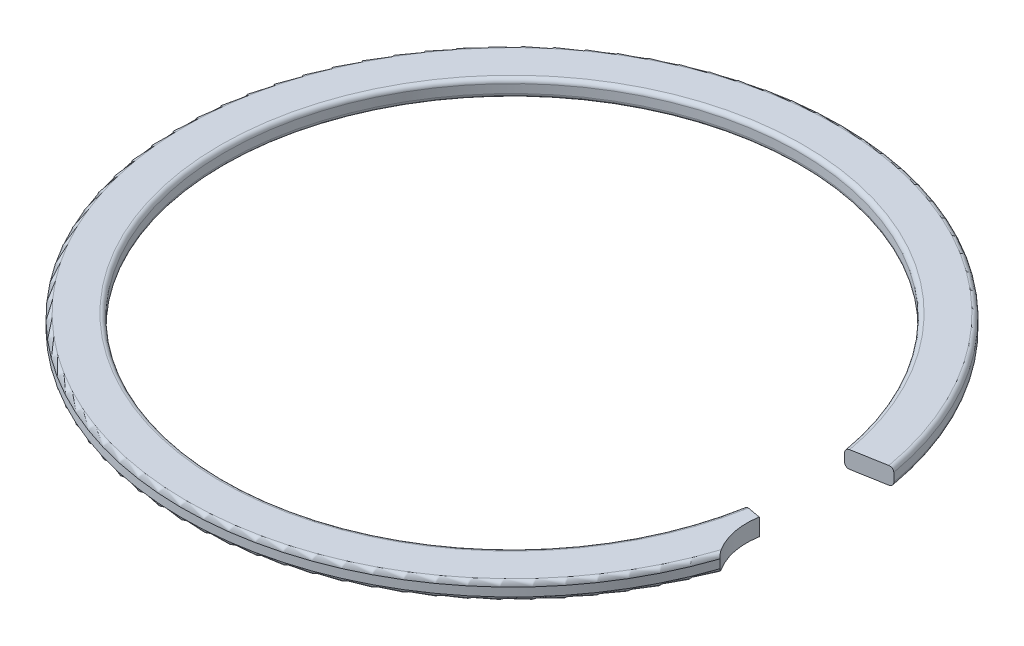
ISO-10303-21;
HEADER;
FILE_DESCRIPTION(('STEP AP214'),'2;1');
FILE_NAME('part.step','',(''),(''),'','','');
FILE_SCHEMA(('AUTOMOTIVE_DESIGN { 1 0 10303 214 1 1 1 1 }'));
ENDSEC;
DATA;
#1=APPLICATION_CONTEXT('core data for automotive mechanical design processes');
#2=APPLICATION_PROTOCOL_DEFINITION('international standard','automotive_design',2000,#1);
#3=PRODUCT_CONTEXT('',#1,'mechanical');
#4=PRODUCT('Part','Part','',(#3));
#5=PRODUCT_RELATED_PRODUCT_CATEGORY('part','',(#4));
#6=PRODUCT_DEFINITION_FORMATION('','',#4);
#7=PRODUCT_DEFINITION_CONTEXT('part definition',#1,'design');
#8=PRODUCT_DEFINITION('design','',#6,#7);
#9=PRODUCT_DEFINITION_SHAPE('','',#8);
#10=(LENGTH_UNIT() NAMED_UNIT(*) SI_UNIT(.MILLI.,.METRE.));
#11=(NAMED_UNIT(*) PLANE_ANGLE_UNIT() SI_UNIT($,.RADIAN.));
#12=(NAMED_UNIT(*) SI_UNIT($,.STERADIAN.) SOLID_ANGLE_UNIT());
#13=UNCERTAINTY_MEASURE_WITH_UNIT(LENGTH_MEASURE(1.E-05),#10,'distance_accuracy_value','');
#14=(GEOMETRIC_REPRESENTATION_CONTEXT(3) GLOBAL_UNCERTAINTY_ASSIGNED_CONTEXT((#13)) GLOBAL_UNIT_ASSIGNED_CONTEXT((#10,
#11,#12)) REPRESENTATION_CONTEXT('',''));
#15=CARTESIAN_POINT('',(0.,0.,0.));
#16=DIRECTION('',(0.,0.,1.));
#17=DIRECTION('',(1.,0.,0.));
#18=AXIS2_PLACEMENT_3D('',#15,#16,#17);
#19=CARTESIAN_POINT('',(0.,0.115000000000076,0.));
#20=DIRECTION('',(0.,1.,0.));
#21=DIRECTION('',(0.,0.,1.));
#22=AXIS2_PLACEMENT_3D('',#19,#20,#21);
#23=TOROIDAL_SURFACE('',#22,7.83499999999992,0.114999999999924);
#24=CARTESIAN_POINT('',(7.71596874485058,0.115000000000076,-1.36053347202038));
#25=DIRECTION('',(0.17364817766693,0.,0.984807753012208));
#26=DIRECTION('',(0.984807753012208,0.,-0.17364817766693));
#27=AXIS2_PLACEMENT_3D('',#24,#25,#26);
#28=CIRCLE('',#27,0.114999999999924);
#29=CARTESIAN_POINT('',(7.71596874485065,0.23,-1.36053347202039));
#30=VERTEX_POINT('',#29);
#31=CARTESIAN_POINT('',(7.60271585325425,0.115,-1.3405639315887));
#32=VERTEX_POINT('',#31);
#33=EDGE_CURVE('E145',#30,#32,#28,.T.);
#34=ORIENTED_EDGE('',*,*,#33,.F.);
#35=CARTESIAN_POINT('',(0.,0.23,0.));
#36=DIRECTION('',(0.,1.,0.));
#37=DIRECTION('',(0.,0.,1.));
#38=AXIS2_PLACEMENT_3D('',#35,#36,#37);
#39=CIRCLE('',#38,7.835);
#40=CARTESIAN_POINT('',(7.71596874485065,0.23,1.36053347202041));
#41=VERTEX_POINT('',#40);
#42=EDGE_CURVE('E147',#30,#41,#39,.T.);
#43=ORIENTED_EDGE('',*,*,#42,.T.);
#44=CARTESIAN_POINT('',(7.71596874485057,0.115000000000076,1.3605334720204));
#45=DIRECTION('',(0.173648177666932,0.,-0.984807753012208));
#46=DIRECTION('',(-0.984807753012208,0.,-0.173648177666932));
#47=AXIS2_PLACEMENT_3D('',#44,#45,#46);
#48=CIRCLE('',#47,0.114999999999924);
#49=CARTESIAN_POINT('',(7.60271585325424,0.115,1.34056393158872));
#50=VERTEX_POINT('',#49);
#51=EDGE_CURVE('E113',#50,#41,#48,.T.);
#52=ORIENTED_EDGE('',*,*,#51,.F.);
#53=CARTESIAN_POINT('',(0.,0.115,0.));
#54=DIRECTION('',(0.,1.,0.));
#55=DIRECTION('',(0.,0.,1.));
#56=AXIS2_PLACEMENT_3D('',#53,#54,#55);
#57=CIRCLE('',#56,7.72);
#58=EDGE_CURVE('E165',#32,#50,#57,.T.);
#59=ORIENTED_EDGE('',*,*,#58,.F.);
#60=EDGE_LOOP('',(#34,#43,#52,#59));
#61=FACE_BOUND('',#60,.T.);
#62=ADVANCED_FACE('F38',(#61),#23,.T.);
#63=CARTESIAN_POINT('',(0.,-0.46,0.));
#64=DIRECTION('',(0.,1.,0.));
#65=DIRECTION('',(0.,0.,1.));
#66=AXIS2_PLACEMENT_3D('',#63,#64,#65);
#67=CYLINDRICAL_SURFACE('',#66,7.72);
#68=DIRECTION('',(0.,1.,0.));
#69=VECTOR('',#68,1.);
#70=CARTESIAN_POINT('',(7.60271585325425,-0.46,-1.3405639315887));
#71=LINE('',#70,#69);
#72=CARTESIAN_POINT('',(7.60271585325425,-0.115,-1.3405639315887));
#73=VERTEX_POINT('',#72);
#74=EDGE_CURVE('E143',#32,#73,#71,.F.);
#75=ORIENTED_EDGE('',*,*,#74,.F.);
#76=ORIENTED_EDGE('',*,*,#58,.T.);
#77=DIRECTION('',(0.,1.,0.));
#78=VECTOR('',#77,1.);
#79=CARTESIAN_POINT('',(7.60271585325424,-0.46,1.34056393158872));
#80=LINE('',#79,#78);
#81=CARTESIAN_POINT('',(7.60271585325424,-0.115,1.34056393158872));
#82=VERTEX_POINT('',#81);
#83=EDGE_CURVE('E132',#82,#50,#80,.T.);
#84=ORIENTED_EDGE('',*,*,#83,.F.);
#85=CARTESIAN_POINT('',(0.,-0.115,0.));
#86=DIRECTION('',(0.,1.,0.));
#87=DIRECTION('',(0.,0.,1.));
#88=AXIS2_PLACEMENT_3D('',#85,#86,#87);
#89=CIRCLE('',#88,7.72);
#90=EDGE_CURVE('E162',#73,#82,#89,.T.);
#91=ORIENTED_EDGE('',*,*,#90,.F.);
#92=EDGE_LOOP('',(#75,#76,#84,#91));
#93=FACE_BOUND('',#92,.T.);
#94=ADVANCED_FACE('F188',(#93),#67,.F.);
#95=CARTESIAN_POINT('',(0.,-0.115000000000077,0.));
#96=DIRECTION('',(0.,1.,0.));
#97=DIRECTION('',(0.,0.,1.));
#98=AXIS2_PLACEMENT_3D('',#95,#96,#97);
#99=TOROIDAL_SURFACE('',#98,7.83499999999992,0.114999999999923);
#100=CARTESIAN_POINT('',(7.71596874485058,-0.115000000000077,-1.36053347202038));
#101=DIRECTION('',(0.17364817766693,0.,0.984807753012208));
#102=DIRECTION('',(0.984807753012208,0.,-0.17364817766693));
#103=AXIS2_PLACEMENT_3D('',#100,#101,#102);
#104=CIRCLE('',#103,0.114999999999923);
#105=CARTESIAN_POINT('',(7.71596874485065,-0.23,-1.36053347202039));
#106=VERTEX_POINT('',#105);
#107=EDGE_CURVE('E141',#73,#106,#104,.T.);
#108=ORIENTED_EDGE('',*,*,#107,.F.);
#109=ORIENTED_EDGE('',*,*,#90,.T.);
#110=CARTESIAN_POINT('',(7.71596874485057,-0.115000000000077,1.3605334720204));
#111=DIRECTION('',(0.173648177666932,0.,-0.984807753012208));
#112=DIRECTION('',(-0.984807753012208,0.,-0.173648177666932));
#113=AXIS2_PLACEMENT_3D('',#110,#111,#112);
#114=CIRCLE('',#113,0.114999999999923);
#115=CARTESIAN_POINT('',(7.71596874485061,-0.23,1.36053347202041));
#116=VERTEX_POINT('',#115);
#117=EDGE_CURVE('E128',#116,#82,#114,.T.);
#118=ORIENTED_EDGE('',*,*,#117,.F.);
#119=CARTESIAN_POINT('',(0.,-0.23,0.));
#120=DIRECTION('',(0.,1.,0.));
#121=DIRECTION('',(0.,0.,1.));
#122=AXIS2_PLACEMENT_3D('',#119,#120,#121);
#123=CIRCLE('',#122,7.835);
#124=EDGE_CURVE('E127',#106,#116,#123,.T.);
#125=ORIENTED_EDGE('',*,*,#124,.F.);
#126=EDGE_LOOP('',(#108,#109,#118,#125));
#127=FACE_BOUND('',#126,.T.);
#128=ADVANCED_FACE('F192',(#127),#99,.T.);
#129=CARTESIAN_POINT('',(7.835,-0.23,0.));
#130=DIRECTION('',(0.,1.,0.));
#131=DIRECTION('',(0.,0.,1.));
#132=AXIS2_PLACEMENT_3D('',#129,#130,#131);
#133=PLANE('',#132);
#134=DIRECTION('',(0.984807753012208,0.,-0.17364817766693));
#135=VECTOR('',#134,1.);
#136=CARTESIAN_POINT('',(7.5987458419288,-0.23,-1.3398639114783));
#137=LINE('',#136,#135);
#138=CARTESIAN_POINT('',(8.6121438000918,-0.23,-1.51855331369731));
#139=VERTEX_POINT('',#138);
#140=EDGE_CURVE('E139',#106,#139,#137,.T.);
#141=ORIENTED_EDGE('',*,*,#140,.F.);
#142=ORIENTED_EDGE('',*,*,#124,.T.);
#143=DIRECTION('',(-0.984807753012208,0.,-0.173648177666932));
#144=VECTOR('',#143,1.);
#145=CARTESIAN_POINT('',(7.59874584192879,-0.23,1.33986391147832));
#146=LINE('',#145,#144);
#147=CARTESIAN_POINT('',(8.070499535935,-0.23,1.4230468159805));
#148=VERTEX_POINT('',#147);
#149=EDGE_CURVE('E117',#148,#116,#146,.T.);
#150=ORIENTED_EDGE('',*,*,#149,.F.);
#151=CARTESIAN_POINT('',(9.8480775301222,-0.23,1.73648177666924));
#152=DIRECTION('',(0.,1.,0.));
#153=DIRECTION('',(0.,0.,1.));
#154=AXIS2_PLACEMENT_3D('',#151,#152,#153);
#155=CIRCLE('',#154,1.80500000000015);
#156=CARTESIAN_POINT('',(8.3191147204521,-0.230000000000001,2.69580326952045));
#157=VERTEX_POINT('',#156);
#158=EDGE_CURVE('E105',#157,#148,#155,.F.);
#159=ORIENTED_EDGE('',*,*,#158,.F.);
#160=CARTESIAN_POINT('',(0.,-0.23,0.));
#161=DIRECTION('',(0.,1.,0.));
#162=DIRECTION('',(0.,0.,1.));
#163=AXIS2_PLACEMENT_3D('',#160,#161,#162);
#164=CIRCLE('',#163,8.745);
#165=EDGE_CURVE('E159',#139,#157,#164,.T.);
#166=ORIENTED_EDGE('',*,*,#165,.F.);
#167=EDGE_LOOP('',(#141,#142,#150,#159,#166));
#168=FACE_BOUND('',#167,.T.);
#169=ADVANCED_FACE('F125',(#168),#133,.F.);
#170=CARTESIAN_POINT('',(0.,-0.115000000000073,0.));
#171=DIRECTION('',(0.,1.,0.));
#172=DIRECTION('',(0.,0.,1.));
#173=AXIS2_PLACEMENT_3D('',#170,#171,#172);
#174=TOROIDAL_SURFACE('',#173,8.74500000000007,0.114999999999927);
#175=CARTESIAN_POINT('',(8.61214380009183,-0.115000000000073,-1.51855331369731));
#176=DIRECTION('',(0.17364817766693,0.,0.984807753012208));
#177=DIRECTION('',(0.984807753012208,0.,-0.17364817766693));
#178=AXIS2_PLACEMENT_3D('',#175,#176,#177);
#179=CIRCLE('',#178,0.114999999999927);
#180=CARTESIAN_POINT('',(8.72539669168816,-0.115,-1.538522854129));
#181=VERTEX_POINT('',#180);
#182=EDGE_CURVE('E137',#139,#181,#179,.T.);
#183=ORIENTED_EDGE('',*,*,#182,.F.);
#184=ORIENTED_EDGE('',*,*,#165,.T.);
#185=CARTESIAN_POINT('',(8.40085666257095,-0.1148,2.81517392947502));
#186=CARTESIAN_POINT('',(8.40086991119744,-0.120416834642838,2.81519041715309));
#187=CARTESIAN_POINT('',(8.40057188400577,-0.126027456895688,2.81479186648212));
#188=CARTESIAN_POINT('',(8.39940254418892,-0.137050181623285,2.81322104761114));
#189=CARTESIAN_POINT('',(8.39853411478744,-0.142463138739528,2.8120526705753));
#190=CARTESIAN_POINT('',(8.39627364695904,-0.152958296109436,2.80899930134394));
#191=CARTESIAN_POINT('',(8.39488217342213,-0.158040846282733,2.80711508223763));
#192=CARTESIAN_POINT('',(8.39165049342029,-0.167773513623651,2.80271475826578));
#193=CARTESIAN_POINT('',(8.3898098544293,-0.172423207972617,2.80019804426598));
#194=CARTESIAN_POINT('',(8.38564639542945,-0.18146341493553,2.79446730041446));
#195=CARTESIAN_POINT('',(8.38330193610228,-0.18582365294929,2.79122149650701));
#196=CARTESIAN_POINT('',(8.37830014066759,-0.19392570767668,2.78424028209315));
#197=CARTESIAN_POINT('',(8.37564269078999,-0.197667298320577,2.78050469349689));
#198=CARTESIAN_POINT('',(8.36964025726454,-0.205085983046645,2.77199111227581));
#199=CARTESIAN_POINT('',(8.36625437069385,-0.208649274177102,2.76714301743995));
#200=CARTESIAN_POINT('',(8.35928795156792,-0.214924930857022,2.75705430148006));
#201=CARTESIAN_POINT('',(8.35570729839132,-0.217636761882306,2.75181343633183));
#202=CARTESIAN_POINT('',(8.34770872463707,-0.222702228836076,2.73996529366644));
#203=CARTESIAN_POINT('',(8.34326760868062,-0.224873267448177,2.7332956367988));
#204=CARTESIAN_POINT('',(8.33435662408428,-0.228087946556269,2.71971126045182));
#205=CARTESIAN_POINT('',(8.32988674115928,-0.229130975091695,2.71279641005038));
#206=CARTESIAN_POINT('',(8.32013584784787,-0.230244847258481,2.69747959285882));
#207=CARTESIAN_POINT('',(8.31486784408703,-0.230084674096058,2.68905214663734));
#208=CARTESIAN_POINT('',(8.3045343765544,-0.228295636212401,2.67221539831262));
#209=CARTESIAN_POINT('',(8.29946923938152,-0.226664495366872,2.66380614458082));
#210=CARTESIAN_POINT('',(8.28907269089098,-0.221677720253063,2.6462316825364));
#211=CARTESIAN_POINT('',(8.28378005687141,-0.218141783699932,2.63709392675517));
#212=CARTESIAN_POINT('',(8.27374702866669,-0.209220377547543,2.61943752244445));
#213=CARTESIAN_POINT('',(8.26900551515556,-0.20383874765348,2.61091763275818));
#214=CARTESIAN_POINT('',(8.2619831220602,-0.193586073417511,2.59808545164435));
#215=CARTESIAN_POINT('',(8.2594593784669,-0.18932122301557,2.59341939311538));
#216=CARTESIAN_POINT('',(8.25478294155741,-0.180032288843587,2.58469263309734));
#217=CARTESIAN_POINT('',(8.25262970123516,-0.175009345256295,2.58063104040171));
#218=CARTESIAN_POINT('',(8.24920044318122,-0.165342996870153,2.57411401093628));
#219=CARTESIAN_POINT('',(8.24783512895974,-0.160838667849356,2.57150024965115));
#220=CARTESIAN_POINT('',(8.24547209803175,-0.151415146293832,2.566955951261));
#221=CARTESIAN_POINT('',(8.24447342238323,-0.146497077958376,2.56502363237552));
#222=CARTESIAN_POINT('',(8.24303337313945,-0.137153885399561,2.56223020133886));
#223=CARTESIAN_POINT('',(8.24252852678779,-0.132775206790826,2.56124741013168));
#224=CARTESIAN_POINT('',(8.24184832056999,-0.123867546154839,2.55992144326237));
#225=CARTESIAN_POINT('',(8.24167523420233,-0.119337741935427,2.55958268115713));
#226=CARTESIAN_POINT('',(8.24168369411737,-0.1148,2.55960014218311));
#227=B_SPLINE_CURVE_WITH_KNOTS('',3,(#185,#186,#187,#188,#189,#190,#191,#192,#193,#194,#195,
#196,#197,#198,#199,#200,#201,#202,#203,#204,#205,#206,#207,#208,#209,#210,#211,#212,#213,#214,
#215,#216,#217,#218,#219,#220,#221,#222,#223,#224,#225,#226),.UNSPECIFIED.,.F.,.F.,(4,2,2,2,2,2,
2,2,2,2,2,2,2,2,2,2,2,2,2,2,4),(0.,0.0168160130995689,0.0335476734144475,0.0502613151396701,
0.066991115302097,0.084682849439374,0.102381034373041,0.123017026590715,0.143665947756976,
0.168480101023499,0.193307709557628,0.223008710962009,0.252755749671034,0.28600237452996,
0.319180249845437,0.339538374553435,0.35986617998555,0.375957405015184,0.392006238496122,
0.405495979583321,0.419077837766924),.UNSPECIFIED.);
#228=CARTESIAN_POINT('',(8.40085678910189,-0.115,2.81517409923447));
#229=VERTEX_POINT('',#228);
#230=EDGE_CURVE('E108',#229,#157,#227,.T.);
#231=ORIENTED_EDGE('',*,*,#230,.F.);
#232=CARTESIAN_POINT('',(0.,-0.115,0.));
#233=DIRECTION('',(0.,1.,0.));
#234=DIRECTION('',(0.,0.,1.));
#235=AXIS2_PLACEMENT_3D('',#232,#233,#234);
#236=CIRCLE('',#235,8.86);
#237=EDGE_CURVE('E156',#181,#229,#236,.T.);
#238=ORIENTED_EDGE('',*,*,#237,.F.);
#239=EDGE_LOOP('',(#183,#184,#231,#238));
#240=FACE_BOUND('',#239,.T.);
#241=ADVANCED_FACE('F202',(#240),#174,.T.);
#242=CARTESIAN_POINT('',(0.,-0.46,0.));
#243=DIRECTION('',(0.,1.,0.));
#244=DIRECTION('',(0.,0.,1.));
#245=AXIS2_PLACEMENT_3D('',#242,#243,#244);
#246=CYLINDRICAL_SURFACE('',#245,8.86);
#247=DIRECTION('',(0.,1.,0.));
#248=VECTOR('',#247,1.);
#249=CARTESIAN_POINT('',(8.72539669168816,-0.46,-1.538522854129));
#250=LINE('',#249,#248);
#251=CARTESIAN_POINT('',(8.72539669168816,0.115,-1.538522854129));
#252=VERTEX_POINT('',#251);
#253=EDGE_CURVE('E130',#181,#252,#250,.T.);
#254=ORIENTED_EDGE('',*,*,#253,.F.);
#255=ORIENTED_EDGE('',*,*,#237,.T.);
#256=DIRECTION('',(0.,-1.,0.));
#257=VECTOR('',#256,1.);
#258=CARTESIAN_POINT('',(8.40085678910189,0.,2.81517409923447));
#259=LINE('',#258,#257);
#260=CARTESIAN_POINT('',(8.40085678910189,0.115000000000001,2.81517409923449));
#261=VERTEX_POINT('',#260);
#262=EDGE_CURVE('E176',#261,#229,#259,.T.);
#263=ORIENTED_EDGE('',*,*,#262,.F.);
#264=CARTESIAN_POINT('',(0.,0.115,0.));
#265=DIRECTION('',(0.,1.,0.));
#266=DIRECTION('',(0.,0.,1.));
#267=AXIS2_PLACEMENT_3D('',#264,#265,#266);
#268=CIRCLE('',#267,8.86);
#269=EDGE_CURVE('E153',#252,#261,#268,.T.);
#270=ORIENTED_EDGE('',*,*,#269,.F.);
#271=EDGE_LOOP('',(#254,#255,#263,#270));
#272=FACE_BOUND('',#271,.T.);
#273=ADVANCED_FACE('F219',(#272),#246,.T.);
#274=CARTESIAN_POINT('',(0.,0.115000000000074,0.));
#275=DIRECTION('',(0.,1.,0.));
#276=DIRECTION('',(0.,0.,1.));
#277=AXIS2_PLACEMENT_3D('',#274,#275,#276);
#278=TOROIDAL_SURFACE('',#277,8.74500000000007,0.114999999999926);
#279=CARTESIAN_POINT('',(8.61214380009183,0.115000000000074,-1.51855331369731));
#280=DIRECTION('',(0.17364817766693,0.,0.984807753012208));
#281=DIRECTION('',(0.984807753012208,0.,-0.17364817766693));
#282=AXIS2_PLACEMENT_3D('',#279,#280,#281);
#283=CIRCLE('',#282,0.114999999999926);
#284=CARTESIAN_POINT('',(8.61214380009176,0.23,-1.5185533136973));
#285=VERTEX_POINT('',#284);
#286=EDGE_CURVE('E59',#252,#285,#283,.T.);
#287=ORIENTED_EDGE('',*,*,#286,.F.);
#288=ORIENTED_EDGE('',*,*,#269,.T.);
#289=CARTESIAN_POINT('',(8.24168369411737,0.1148,2.55960014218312));
#290=CARTESIAN_POINT('',(8.24167235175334,0.119972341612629,2.55957650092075));
#291=CARTESIAN_POINT('',(8.241899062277,0.125131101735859,2.56002050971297));
#292=CARTESIAN_POINT('',(8.24278008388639,0.135222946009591,2.56173728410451));
#293=CARTESIAN_POINT('',(8.24343033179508,0.140157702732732,2.56300217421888));
#294=CARTESIAN_POINT('',(8.24510874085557,0.149691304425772,2.5662523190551));
#295=CARTESIAN_POINT('',(8.24613569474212,0.154291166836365,2.5682352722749));
#296=CARTESIAN_POINT('',(8.24850934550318,0.163108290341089,2.57279110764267));
#297=CARTESIAN_POINT('',(8.24985685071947,0.167324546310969,2.57536548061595));
#298=CARTESIAN_POINT('',(8.25346479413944,0.177087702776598,2.58220977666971));
#299=CARTESIAN_POINT('',(8.25586651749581,0.182407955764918,2.58672832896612));
#300=CARTESIAN_POINT('',(8.26108480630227,0.192164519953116,2.59642924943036));
#301=CARTESIAN_POINT('',(8.26390219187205,0.196599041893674,2.6016129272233));
#302=CARTESIAN_POINT('',(8.2708924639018,0.206004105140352,2.61430925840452));
#303=CARTESIAN_POINT('',(8.27519671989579,0.210627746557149,2.62200643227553));
#304=CARTESIAN_POINT('',(8.28423327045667,0.218398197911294,2.63786949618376));
#305=CARTESIAN_POINT('',(8.28896580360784,0.221544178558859,2.64603564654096));
#306=CARTESIAN_POINT('',(8.29883467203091,0.226432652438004,2.66274701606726));
#307=CARTESIAN_POINT('',(8.3039766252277,0.228149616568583,2.67129636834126));
#308=CARTESIAN_POINT('',(8.31448398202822,0.23006339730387,2.68843607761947));
#309=CARTESIAN_POINT('',(8.3198495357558,0.230259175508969,2.69702645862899));
#310=CARTESIAN_POINT('',(8.33122332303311,0.228997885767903,2.714899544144));
#311=CARTESIAN_POINT('',(8.33724185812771,0.227372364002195,2.72416483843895));
#312=CARTESIAN_POINT('',(8.34916179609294,0.222048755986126,2.74216182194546));
#313=CARTESIAN_POINT('',(8.35506340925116,0.218354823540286,2.75089454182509));
#314=CARTESIAN_POINT('',(8.36450320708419,0.2103805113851,2.76462427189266));
#315=CARTESIAN_POINT('',(8.36816985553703,0.206713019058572,2.76989141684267));
#316=CARTESIAN_POINT('',(8.3751651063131,0.198391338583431,2.77983728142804));
#317=CARTESIAN_POINT('',(8.37849421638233,0.193738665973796,2.78451688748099));
#318=CARTESIAN_POINT('',(8.3841617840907,0.184290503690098,2.79241527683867));
#319=CARTESIAN_POINT('',(8.38657362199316,0.179634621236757,2.79574803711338));
#320=CARTESIAN_POINT('',(8.39093144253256,0.169700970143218,2.80173480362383));
#321=CARTESIAN_POINT('',(8.39287735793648,0.164423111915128,2.8043887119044));
#322=CARTESIAN_POINT('',(8.39620145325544,0.15332180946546,2.80890371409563));
#323=CARTESIAN_POINT('',(8.39757555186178,0.147494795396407,2.81075911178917));
#324=CARTESIAN_POINT('',(8.39963556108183,0.135515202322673,2.81353519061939));
#325=CARTESIAN_POINT('',(8.40032325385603,0.129363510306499,2.81445829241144));
#326=CARTESIAN_POINT('',(8.40079035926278,0.120382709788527,2.8150848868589));
#327=CARTESIAN_POINT('',(8.4008614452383,0.11759040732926,2.81518012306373));
#328=CARTESIAN_POINT('',(8.40085666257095,0.1148,2.81517392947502));
#329=B_SPLINE_CURVE_WITH_KNOTS('',3,(#289,#290,#291,#292,#293,#294,#295,#296,#297,#298,#299,
#300,#301,#302,#303,#304,#305,#306,#307,#308,#309,#310,#311,#312,#313,#314,#315,#316,#317,#318,
#319,#320,#321,#322,#323,#324,#325,#326,#327,#328),.UNSPECIFIED.,.F.,.F.,(4,2,2,2,2,2,2,2,2,2,2,
2,2,2,2,2,2,2,2,4),(0.,0.015468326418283,0.0307904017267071,0.0460637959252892,
0.0613761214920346,0.083399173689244,0.105466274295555,0.135181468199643,0.164913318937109,
0.195165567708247,0.225438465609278,0.258760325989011,0.292015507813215,0.314109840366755,
0.336170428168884,0.354733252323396,0.373298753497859,0.391994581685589,0.410641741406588,
0.419014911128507),.UNSPECIFIED.);
#330=CARTESIAN_POINT('',(8.3191147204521,0.23,2.69580326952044));
#331=VERTEX_POINT('',#330);
#332=EDGE_CURVE('E121',#331,#261,#329,.T.);
#333=ORIENTED_EDGE('',*,*,#332,.F.);
#334=CARTESIAN_POINT('',(0.,0.23,0.));
#335=DIRECTION('',(0.,1.,0.));
#336=DIRECTION('',(0.,0.,1.));
#337=AXIS2_PLACEMENT_3D('',#334,#335,#336);
#338=CIRCLE('',#337,8.745);
#339=EDGE_CURVE('E150',#285,#331,#338,.T.);
#340=ORIENTED_EDGE('',*,*,#339,.F.);
#341=EDGE_LOOP('',(#287,#288,#333,#340));
#342=FACE_BOUND('',#341,.T.);
#343=ADVANCED_FACE('F174',(#342),#278,.T.);
#344=CARTESIAN_POINT('',(8.745,0.23,0.));
#345=DIRECTION('',(0.,-1.,0.));
#346=DIRECTION('',(0.,0.,-1.));
#347=AXIS2_PLACEMENT_3D('',#344,#345,#346);
#348=PLANE('',#347);
#349=DIRECTION('',(-0.984807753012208,0.,0.17364817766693));
#350=VECTOR('',#349,1.);
#351=CARTESIAN_POINT('',(8.48130598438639,0.23,-1.49548307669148));
#352=LINE('',#351,#350);
#353=EDGE_CURVE('E11',#285,#30,#352,.T.);
#354=ORIENTED_EDGE('',*,*,#353,.F.);
#355=ORIENTED_EDGE('',*,*,#339,.T.);
#356=CARTESIAN_POINT('',(9.8480775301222,0.23,1.73648177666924));
#357=DIRECTION('',(0.,-1.,0.));
#358=DIRECTION('',(0.,0.,-1.));
#359=AXIS2_PLACEMENT_3D('',#356,#357,#358);
#360=CIRCLE('',#359,1.80500000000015);
#361=CARTESIAN_POINT('',(8.070499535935,0.23,1.4230468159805));
#362=VERTEX_POINT('',#361);
#363=EDGE_CURVE('E168',#362,#331,#360,.F.);
#364=ORIENTED_EDGE('',*,*,#363,.F.);
#365=DIRECTION('',(0.984807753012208,0.,0.173648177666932));
#366=VECTOR('',#365,1.);
#367=CARTESIAN_POINT('',(8.48130598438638,0.23,1.4954830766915));
#368=LINE('',#367,#366);
#369=EDGE_CURVE('E45',#41,#362,#368,.T.);
#370=ORIENTED_EDGE('',*,*,#369,.F.);
#371=ORIENTED_EDGE('',*,*,#42,.F.);
#372=EDGE_LOOP('',(#354,#355,#364,#370,#371));
#373=FACE_BOUND('',#372,.T.);
#374=ADVANCED_FACE('F178',(#373),#348,.F.);
#375=CARTESIAN_POINT('',(9.8480775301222,0.46,1.73648177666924));
#376=DIRECTION('',(0.,-1.,0.));
#377=DIRECTION('',(0.,0.,-1.));
#378=AXIS2_PLACEMENT_3D('',#375,#376,#377);
#379=CYLINDRICAL_SURFACE('',#378,1.80500000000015);
#380=ORIENTED_EDGE('',*,*,#158,.T.);
#381=DIRECTION('',(0.,-1.,0.));
#382=VECTOR('',#381,1.);
#383=CARTESIAN_POINT('',(8.070499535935,0.46,1.4230468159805));
#384=LINE('',#383,#382);
#385=EDGE_CURVE('E52',#362,#148,#384,.T.);
#386=ORIENTED_EDGE('',*,*,#385,.F.);
#387=ORIENTED_EDGE('',*,*,#363,.T.);
#388=ORIENTED_EDGE('',*,*,#332,.T.);
#389=ORIENTED_EDGE('',*,*,#262,.T.);
#390=ORIENTED_EDGE('',*,*,#230,.T.);
#391=EDGE_LOOP('',(#380,#386,#387,#388,#389,#390));
#392=FACE_BOUND('',#391,.T.);
#393=ADVANCED_FACE('F106',(#392),#379,.F.);
#394=CARTESIAN_POINT('',(0.,0.46,0.));
#395=DIRECTION('',(0.173648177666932,0.,-0.984807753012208));
#396=DIRECTION('',(-0.984807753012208,0.,-0.173648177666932));
#397=AXIS2_PLACEMENT_3D('',#394,#395,#396);
#398=PLANE('',#397);
#399=ORIENTED_EDGE('',*,*,#149,.T.);
#400=ORIENTED_EDGE('',*,*,#117,.T.);
#401=ORIENTED_EDGE('',*,*,#83,.T.);
#402=ORIENTED_EDGE('',*,*,#51,.T.);
#403=ORIENTED_EDGE('',*,*,#369,.T.);
#404=ORIENTED_EDGE('',*,*,#385,.T.);
#405=EDGE_LOOP('',(#399,#400,#401,#402,#403,#404));
#406=FACE_BOUND('',#405,.T.);
#407=ADVANCED_FACE('F116',(#406),#398,.T.);
#408=CARTESIAN_POINT('',(9.597936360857,0.46,-1.6923751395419));
#409=DIRECTION('',(0.17364817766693,0.,0.984807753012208));
#410=DIRECTION('',(0.984807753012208,0.,-0.17364817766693));
#411=AXIS2_PLACEMENT_3D('',#408,#409,#410);
#412=PLANE('',#411);
#413=ORIENTED_EDGE('',*,*,#33,.T.);
#414=ORIENTED_EDGE('',*,*,#74,.T.);
#415=ORIENTED_EDGE('',*,*,#107,.T.);
#416=ORIENTED_EDGE('',*,*,#140,.T.);
#417=ORIENTED_EDGE('',*,*,#182,.T.);
#418=ORIENTED_EDGE('',*,*,#253,.T.);
#419=ORIENTED_EDGE('',*,*,#286,.T.);
#420=ORIENTED_EDGE('',*,*,#353,.T.);
#421=EDGE_LOOP('',(#413,#414,#415,#416,#417,#418,#419,#420));
#422=FACE_BOUND('',#421,.T.);
#423=ADVANCED_FACE('F181',(#422),#412,.T.);
#424=CLOSED_SHELL('',(#62,#94,#128,#169,#241,#273,#343,#374,#393,#407,#423));
#425=MANIFOLD_SOLID_BREP('B2',#424);
#426=ADVANCED_BREP_SHAPE_REPRESENTATION('',(#18,#425),#14);
#427=SHAPE_DEFINITION_REPRESENTATION(#9,#426);
ENDSEC;
END-ISO-10303-21;
